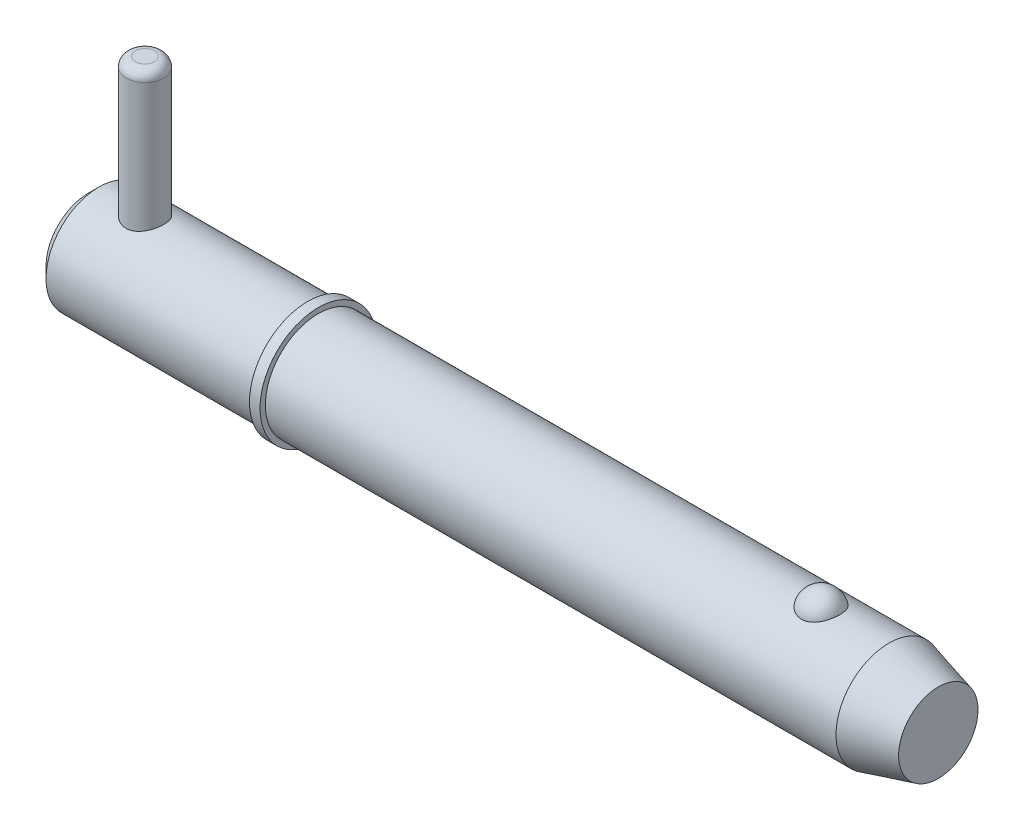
ISO-10303-21;
HEADER;
FILE_DESCRIPTION(('STEP AP214'),'2;1');
FILE_NAME('part.step','',(''),(''),'','','');
FILE_SCHEMA(('AUTOMOTIVE_DESIGN { 1 0 10303 214 1 1 1 1 }'));
ENDSEC;
DATA;
#1=APPLICATION_CONTEXT('core data for automotive mechanical design processes');
#2=APPLICATION_PROTOCOL_DEFINITION('international standard','automotive_design',2000,#1);
#3=PRODUCT_CONTEXT('',#1,'mechanical');
#4=PRODUCT('Part','Part','',(#3));
#5=PRODUCT_RELATED_PRODUCT_CATEGORY('part','',(#4));
#6=PRODUCT_DEFINITION_FORMATION('','',#4);
#7=PRODUCT_DEFINITION_CONTEXT('part definition',#1,'design');
#8=PRODUCT_DEFINITION('design','',#6,#7);
#9=PRODUCT_DEFINITION_SHAPE('','',#8);
#10=(LENGTH_UNIT() NAMED_UNIT(*) SI_UNIT(.MILLI.,.METRE.));
#11=(NAMED_UNIT(*) PLANE_ANGLE_UNIT() SI_UNIT($,.RADIAN.));
#12=(NAMED_UNIT(*) SI_UNIT($,.STERADIAN.) SOLID_ANGLE_UNIT());
#13=UNCERTAINTY_MEASURE_WITH_UNIT(LENGTH_MEASURE(1.E-05),#10,'distance_accuracy_value','');
#14=(GEOMETRIC_REPRESENTATION_CONTEXT(3) GLOBAL_UNCERTAINTY_ASSIGNED_CONTEXT((#13)) GLOBAL_UNIT_ASSIGNED_CONTEXT((#10,
#11,#12)) REPRESENTATION_CONTEXT('',''));
#15=CARTESIAN_POINT('',(0.,0.,0.));
#16=DIRECTION('',(0.,0.,1.));
#17=DIRECTION('',(1.,0.,0.));
#18=AXIS2_PLACEMENT_3D('',#15,#16,#17);
#19=CARTESIAN_POINT('',(5.94,19.845,0.));
#20=DIRECTION('',(0.,-1.,0.));
#21=DIRECTION('',(0.,0.,-1.));
#22=AXIS2_PLACEMENT_3D('',#19,#20,#21);
#23=CYLINDRICAL_SURFACE('',#22,1.98);
#24=CARTESIAN_POINT('',(5.94,-4.565,0.));
#25=DIRECTION('',(0.,1.,0.));
#26=DIRECTION('',(0.,0.,1.));
#27=AXIS2_PLACEMENT_3D('',#24,#25,#26);
#28=CIRCLE('',#27,1.98);
#29=CARTESIAN_POINT('',(5.94,-4.565,1.98));
#30=VERTEX_POINT('',#29);
#31=EDGE_CURVE('P0_E25',#30,#30,#28,.T.);
#32=ORIENTED_EDGE('',*,*,#31,.T.);
#33=EDGE_LOOP('',(#32));
#34=FACE_BOUND('',#33,.T.);
#35=CARTESIAN_POINT('',(5.94,18.855,0.));
#36=DIRECTION('',(0.,1.,0.));
#37=DIRECTION('',(0.,0.,1.));
#38=AXIS2_PLACEMENT_3D('',#35,#36,#37);
#39=CIRCLE('',#38,1.98);
#40=CARTESIAN_POINT('',(5.94,18.855,1.98));
#41=VERTEX_POINT('',#40);
#42=EDGE_CURVE('P0_E29',#41,#41,#39,.F.);
#43=ORIENTED_EDGE('',*,*,#42,.T.);
#44=EDGE_LOOP('',(#43));
#45=FACE_BOUND('',#44,.T.);
#46=ADVANCED_FACE('P0_F14',(#34,#45),#23,.T.);
#47=CARTESIAN_POINT('',(5.94,19.845,0.));
#48=DIRECTION('',(0.,1.,0.));
#49=DIRECTION('',(0.,0.,1.));
#50=AXIS2_PLACEMENT_3D('',#47,#48,#49);
#51=PLANE('',#50);
#52=CARTESIAN_POINT('',(5.94,19.845,0.));
#53=DIRECTION('',(0.,1.,0.));
#54=DIRECTION('',(0.,0.,1.));
#55=AXIS2_PLACEMENT_3D('',#52,#53,#54);
#56=CIRCLE('',#55,0.99);
#57=CARTESIAN_POINT('',(5.94,19.845,0.99));
#58=VERTEX_POINT('',#57);
#59=EDGE_CURVE('P0_E10',#58,#58,#56,.T.);
#60=ORIENTED_EDGE('',*,*,#59,.T.);
#61=EDGE_LOOP('',(#60));
#62=FACE_BOUND('',#61,.T.);
#63=ADVANCED_FACE('P0_F46',(#62),#51,.T.);
#64=CARTESIAN_POINT('',(5.94,-5.555,0.));
#65=DIRECTION('',(0.,1.,0.));
#66=DIRECTION('',(0.,0.,1.));
#67=AXIS2_PLACEMENT_3D('',#64,#65,#66);
#68=PLANE('',#67);
#69=CARTESIAN_POINT('',(5.94,-5.555,0.));
#70=DIRECTION('',(0.,1.,0.));
#71=DIRECTION('',(0.,0.,1.));
#72=AXIS2_PLACEMENT_3D('',#69,#70,#71);
#73=CIRCLE('',#72,0.99);
#74=CARTESIAN_POINT('',(5.94,-5.555,0.99));
#75=VERTEX_POINT('',#74);
#76=EDGE_CURVE('P0_E21',#75,#75,#73,.F.);
#77=ORIENTED_EDGE('',*,*,#76,.T.);
#78=EDGE_LOOP('',(#77));
#79=FACE_BOUND('',#78,.T.);
#80=ADVANCED_FACE('P0_F43',(#79),#68,.F.);
#81=CARTESIAN_POINT('',(5.94,-4.565,0.));
#82=DIRECTION('',(0.,1.,0.));
#83=DIRECTION('',(0.,0.,1.));
#84=AXIS2_PLACEMENT_3D('',#81,#82,#83);
#85=DEGENERATE_TOROIDAL_SURFACE('',#84,0.99,0.99,.T.);
#86=ORIENTED_EDGE('',*,*,#76,.F.);
#87=EDGE_LOOP('',(#86));
#88=FACE_BOUND('',#87,.T.);
#89=ORIENTED_EDGE('',*,*,#31,.F.);
#90=EDGE_LOOP('',(#89));
#91=FACE_BOUND('',#90,.T.);
#92=ADVANCED_FACE('P0_F38',(#88,#91),#85,.T.);
#93=CARTESIAN_POINT('',(5.94,18.855,0.));
#94=DIRECTION('',(0.,1.,0.));
#95=DIRECTION('',(0.,0.,1.));
#96=AXIS2_PLACEMENT_3D('',#93,#94,#95);
#97=DEGENERATE_TOROIDAL_SURFACE('',#96,0.99,0.99,.T.);
#98=ORIENTED_EDGE('',*,*,#42,.F.);
#99=EDGE_LOOP('',(#98));
#100=FACE_BOUND('',#99,.T.);
#101=ORIENTED_EDGE('',*,*,#59,.F.);
#102=EDGE_LOOP('',(#101));
#103=FACE_BOUND('',#102,.T.);
#104=ADVANCED_FACE('P0_F16',(#100,#103),#97,.T.);
#105=CLOSED_SHELL('',(#46,#63,#80,#92,#104));
#106=MANIFOLD_SOLID_BREP('P0_B1',#105);
#107=CARTESIAN_POINT('',(0.,0.,0.));
#108=DIRECTION('',(1.,0.,0.));
#109=DIRECTION('',(0.,0.,-1.));
#110=AXIS2_PLACEMENT_3D('',#107,#108,#109);
#111=CYLINDRICAL_SURFACE('',#110,5.555);
#112=CARTESIAN_POINT('',(84.0171144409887,0.,0.));
#113=DIRECTION('',(1.,0.,0.));
#114=DIRECTION('',(0.,0.,-1.));
#115=AXIS2_PLACEMENT_3D('',#112,#113,#114);
#116=CIRCLE('',#115,5.555);
#117=CARTESIAN_POINT('',(84.0171144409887,0.,-5.555));
#118=VERTEX_POINT('',#117);
#119=EDGE_CURVE('P1_E81',#118,#118,#116,.T.);
#120=ORIENTED_EDGE('',*,*,#119,.F.);
#121=EDGE_LOOP('',(#120));
#122=FACE_BOUND('',#121,.T.);
#123=CARTESIAN_POINT('',(24.13,0.,0.));
#124=DIRECTION('',(1.,0.,0.));
#125=DIRECTION('',(0.,0.,-1.));
#126=AXIS2_PLACEMENT_3D('',#123,#124,#125);
#127=CIRCLE('',#126,5.555);
#128=CARTESIAN_POINT('',(24.13,0.,-5.555));
#129=VERTEX_POINT('',#128);
#130=EDGE_CURVE('P1_E85',#129,#129,#127,.T.);
#131=ORIENTED_EDGE('',*,*,#130,.T.);
#132=EDGE_LOOP('',(#131));
#133=FACE_BOUND('',#132,.T.);
#134=CARTESIAN_POINT('',(76.8986264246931,5.16741224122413,2.03859650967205));
#135=CARTESIAN_POINT('',(76.7929492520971,5.16740893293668,2.03859990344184));
#136=CARTESIAN_POINT('',(76.68729894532,5.17079470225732,2.03008306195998));
#137=CARTESIAN_POINT('',(76.4791419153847,5.18392795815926,1.9963072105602));
#138=CARTESIAN_POINT('',(76.3766344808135,5.19367399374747,1.9710520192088));
#139=CARTESIAN_POINT('',(76.1777710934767,5.21839168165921,1.90463997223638));
#140=CARTESIAN_POINT('',(76.0814064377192,5.23335573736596,1.86350622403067));
#141=CARTESIAN_POINT('',(75.8970804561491,5.26688076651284,1.76652592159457));
#142=CARTESIAN_POINT('',(75.8091207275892,5.28544242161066,1.71067657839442));
#143=CARTESIAN_POINT('',(75.6412654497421,5.32479845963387,1.58399959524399));
#144=CARTESIAN_POINT('',(75.5616656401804,5.34564089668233,1.51279545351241));
#145=CARTESIAN_POINT('',(75.4151290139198,5.38697258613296,1.35828584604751));
#146=CARTESIAN_POINT('',(75.348194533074,5.40746177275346,1.27497815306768));
#147=CARTESIAN_POINT('',(75.2256103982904,5.44694508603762,1.09440293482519));
#148=CARTESIAN_POINT('',(75.1705989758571,5.46583143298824,0.996677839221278));
#149=CARTESIAN_POINT('',(75.0769376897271,5.49908030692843,0.792961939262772));
#150=CARTESIAN_POINT('',(75.0382894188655,5.513442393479,0.686970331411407));
#151=CARTESIAN_POINT('',(74.9776807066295,5.536358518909,0.468019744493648));
#152=CARTESIAN_POINT('',(74.9559725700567,5.54482455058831,0.354981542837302));
#153=CARTESIAN_POINT('',(74.9306362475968,5.55473324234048,0.126595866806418));
#154=CARTESIAN_POINT('',(74.9270077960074,5.55617600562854,0.0112484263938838));
#155=CARTESIAN_POINT('',(74.9378817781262,5.55189984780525,-0.218011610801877));
#156=CARTESIAN_POINT('',(74.9523151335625,5.54620821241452,-0.331928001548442));
#157=CARTESIAN_POINT('',(74.998903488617,5.52828920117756,-0.555544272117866));
#158=CARTESIAN_POINT('',(75.0310588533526,5.5160616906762,-0.665244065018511));
#159=CARTESIAN_POINT('',(75.1124883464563,5.48630779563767,-0.877469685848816));
#160=CARTESIAN_POINT('',(75.1617816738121,5.4687754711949,-0.979987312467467));
#161=CARTESIAN_POINT('',(75.2764785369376,5.43024700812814,-1.17486975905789));
#162=CARTESIAN_POINT('',(75.3418831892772,5.4092506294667,-1.26723387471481));
#163=CARTESIAN_POINT('',(75.4875712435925,5.36600927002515,-1.43940133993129));
#164=CARTESIAN_POINT('',(75.5678859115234,5.34376173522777,-1.5191776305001));
#165=CARTESIAN_POINT('',(75.7414520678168,5.30057971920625,-1.66360338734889));
#166=CARTESIAN_POINT('',(75.834702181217,5.27964509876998,-1.72825445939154));
#167=CARTESIAN_POINT('',(76.0293939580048,5.24205250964,-1.8390947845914));
#168=CARTESIAN_POINT('',(76.1305900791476,5.22530519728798,-1.88568407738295));
#169=CARTESIAN_POINT('',(76.3401552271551,5.19750919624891,-1.96100802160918));
#170=CARTESIAN_POINT('',(76.4485215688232,5.18645838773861,-1.98974931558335));
#171=CARTESIAN_POINT('',(76.6634989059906,5.17184410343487,-2.02742262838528));
#172=CARTESIAN_POINT('',(76.769925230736,5.16793282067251,-2.0372760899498));
#173=CARTESIAN_POINT('',(76.9829925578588,5.1669899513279,-2.03966777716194));
#174=CARTESIAN_POINT('',(77.0896335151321,5.16995704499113,-2.03220932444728));
#175=CARTESIAN_POINT('',(77.2967730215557,5.18222383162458,-2.0007117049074));
#176=CARTESIAN_POINT('',(77.3973599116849,5.19133213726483,-1.97717337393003));
#177=CARTESIAN_POINT('',(77.5930141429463,5.21467637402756,-1.91475248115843));
#178=CARTESIAN_POINT('',(77.6880810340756,5.22891272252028,-1.87586867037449));
#179=CARTESIAN_POINT('',(77.872371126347,5.26137066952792,-1.78282713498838));
#180=CARTESIAN_POINT('',(77.9614190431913,5.27967329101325,-1.7283512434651));
#181=CARTESIAN_POINT('',(78.1292880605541,5.31817411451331,-1.60597483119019));
#182=CARTESIAN_POINT('',(78.2081068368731,5.33837274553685,-1.53807126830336));
#183=CARTESIAN_POINT('',(78.3575156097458,5.37968287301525,-1.38688970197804));
#184=CARTESIAN_POINT('',(78.4275058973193,5.40079011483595,-1.30301744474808));
#185=CARTESIAN_POINT('',(78.5530125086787,5.44074401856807,-1.12458170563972));
#186=CARTESIAN_POINT('',(78.6085262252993,5.45959027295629,-1.03001630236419));
#187=CARTESIAN_POINT('',(78.7055507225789,5.49369849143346,-0.829439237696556));
#188=CARTESIAN_POINT('',(78.7465483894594,5.50882422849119,-0.723155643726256));
#189=CARTESIAN_POINT('',(78.8111250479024,5.53310911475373,-0.504772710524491));
#190=CARTESIAN_POINT('',(78.8347036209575,5.54226812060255,-0.39267323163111));
#191=CARTESIAN_POINT('',(78.864013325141,5.55370358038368,-0.165459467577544));
#192=CARTESIAN_POINT('',(78.8696884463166,5.55595843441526,-0.0503368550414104));
#193=CARTESIAN_POINT('',(78.862916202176,5.55329317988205,0.179288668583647));
#194=CARTESIAN_POINT('',(78.8504690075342,5.54837313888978,0.293791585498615));
#195=CARTESIAN_POINT('',(78.8077798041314,5.53189037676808,0.518526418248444));
#196=CARTESIAN_POINT('',(78.777598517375,5.5203503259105,0.628771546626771));
#197=CARTESIAN_POINT('',(78.7000962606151,5.49182453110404,0.84231815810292));
#198=CARTESIAN_POINT('',(78.6527743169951,5.47483847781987,0.945619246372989));
#199=CARTESIAN_POINT('',(78.5417204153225,5.43710633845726,1.14281571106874));
#200=CARTESIAN_POINT('',(78.4779215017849,5.41634501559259,1.23667048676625));
#201=CARTESIAN_POINT('',(78.3353577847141,5.37334572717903,1.4118524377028));
#202=CARTESIAN_POINT('',(78.2565932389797,5.35110778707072,1.49317982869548));
#203=CARTESIAN_POINT('',(78.0864234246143,5.30779474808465,1.64049162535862));
#204=CARTESIAN_POINT('',(77.9951002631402,5.28671324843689,1.70656877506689));
#205=CARTESIAN_POINT('',(77.8017390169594,5.2480485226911,1.82201372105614));
#206=CARTESIAN_POINT('',(77.6997005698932,5.23046541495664,1.87138095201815));
#207=CARTESIAN_POINT('',(77.4836187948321,5.20042692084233,1.95335298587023));
#208=CARTESIAN_POINT('',(77.369260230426,5.18820192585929,1.98521734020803));
#209=CARTESIAN_POINT('',(77.1361307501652,5.17169804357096,2.02783294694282));
#210=CARTESIAN_POINT('',(77.0173616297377,5.16741595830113,2.03859269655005));
#211=CARTESIAN_POINT('',(76.8986264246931,5.16741224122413,2.03859650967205));
#212=B_SPLINE_CURVE_WITH_KNOTS('',3,(#134,#135,#136,#137,#138,#139,#140,#141,#142,#143,#144,
#145,#146,#147,#148,#149,#150,#151,#152,#153,#154,#155,#156,#157,#158,#159,#160,#161,#162,#163,
#164,#165,#166,#167,#168,#169,#170,#171,#172,#173,#174,#175,#176,#177,#178,#179,#180,#181,#182,
#183,#184,#185,#186,#187,#188,#189,#190,#191,#192,#193,#194,#195,#196,#197,#198,#199,#200,#201,
#202,#203,#204,#205,#206,#207,#208,#209,#210,#211),.UNSPECIFIED.,.T.,.F.,(4,2,2,2,2,2,2,2,2,2,2,
2,2,2,2,2,2,2,2,2,2,2,2,2,2,2,2,2,2,2,2,2,2,2,2,2,2,2,4),(0.,0.316595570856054,
0.633118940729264,0.949183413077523,1.26530783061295,1.59030762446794,1.91536729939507,
2.25495824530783,2.59458224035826,2.93917283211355,3.28375835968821,3.62703002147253,
3.97030875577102,4.3139732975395,4.65766166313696,5.00207904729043,5.3464598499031,
5.68270547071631,6.0188258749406,6.33808403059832,6.65728093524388,6.96696376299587,
7.27667180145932,7.59321535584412,7.90983070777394,8.24210387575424,8.57443684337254,
8.91755896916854,9.26068933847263,9.60489211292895,9.949091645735,10.2921194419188,
10.6351667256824,10.9796305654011,11.324088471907,11.666392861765,12.0087088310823,
12.3645679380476,12.7202837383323),.UNSPECIFIED.);
#213=CARTESIAN_POINT('',(76.8986264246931,5.16741224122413,2.03859650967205));
#214=VERTEX_POINT('',#213);
#215=EDGE_CURVE('P1_E35',#214,#214,#212,.T.);
#216=ORIENTED_EDGE('',*,*,#215,.T.);
#217=EDGE_LOOP('',(#216));
#218=FACE_BOUND('',#217,.T.);
#219=ADVANCED_FACE('P1_F13',(#122,#133,#218),#111,.T.);
#220=CARTESIAN_POINT('',(0.,0.,0.));
#221=DIRECTION('',(-1.,0.,0.));
#222=DIRECTION('',(0.,0.,1.));
#223=AXIS2_PLACEMENT_3D('',#220,#221,#222);
#224=PLANE('',#223);
#225=CARTESIAN_POINT('',(0.,0.,0.));
#226=DIRECTION('',(1.,0.,0.));
#227=DIRECTION('',(0.,0.,-1.));
#228=AXIS2_PLACEMENT_3D('',#225,#226,#227);
#229=CIRCLE('',#228,4.444);
#230=CARTESIAN_POINT('',(0.,0.,-4.444));
#231=VERTEX_POINT('',#230);
#232=EDGE_CURVE('P1_E9',#231,#231,#229,.T.);
#233=ORIENTED_EDGE('',*,*,#232,.F.);
#234=EDGE_LOOP('',(#233));
#235=FACE_BOUND('',#234,.T.);
#236=ADVANCED_FACE('P1_F15',(#235),#224,.T.);
#237=CARTESIAN_POINT('',(1.111,0.,0.));
#238=DIRECTION('',(1.,0.,0.));
#239=DIRECTION('',(0.,0.,-1.));
#240=AXIS2_PLACEMENT_3D('',#237,#238,#239);
#241=CONICAL_SURFACE('',#240,5.555,0.78539816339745);
#242=ORIENTED_EDGE('',*,*,#232,.T.);
#243=EDGE_LOOP('',(#242));
#244=FACE_BOUND('',#243,.T.);
#245=CARTESIAN_POINT('',(1.111,0.,0.));
#246=DIRECTION('',(1.,0.,0.));
#247=DIRECTION('',(0.,0.,-1.));
#248=AXIS2_PLACEMENT_3D('',#245,#246,#247);
#249=CIRCLE('',#248,5.555);
#250=CARTESIAN_POINT('',(1.111,0.,-5.555));
#251=VERTEX_POINT('',#250);
#252=EDGE_CURVE('P1_E26',#251,#251,#249,.T.);
#253=ORIENTED_EDGE('',*,*,#252,.F.);
#254=EDGE_LOOP('',(#253));
#255=FACE_BOUND('',#254,.T.);
#256=ADVANCED_FACE('P1_F77',(#244,#255),#241,.T.);
#257=CARTESIAN_POINT('',(0.,0.,0.));
#258=DIRECTION('',(1.,0.,0.));
#259=DIRECTION('',(0.,0.,-1.));
#260=AXIS2_PLACEMENT_3D('',#257,#258,#259);
#261=CYLINDRICAL_SURFACE('',#260,5.555);
#262=CARTESIAN_POINT('',(5.94,-5.19014691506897,1.98));
#263=CARTESIAN_POINT('',(5.83264687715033,-5.19014494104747,1.98000226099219));
#264=CARTESIAN_POINT('',(5.7253094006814,-5.19351395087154,1.97123988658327));
#265=CARTESIAN_POINT('',(5.51384517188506,-5.20654291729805,1.93656219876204));
#266=CARTESIAN_POINT('',(5.40971858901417,-5.21620320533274,1.91064598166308));
#267=CARTESIAN_POINT('',(5.20778082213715,-5.24058443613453,1.84271148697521));
#268=CARTESIAN_POINT('',(5.10995634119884,-5.25529427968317,1.80072850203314));
#269=CARTESIAN_POINT('',(4.92270352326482,-5.28810012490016,1.70197537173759));
#270=CARTESIAN_POINT('',(4.83327743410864,-5.3061970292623,1.64520128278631));
#271=CARTESIAN_POINT('',(4.66135184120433,-5.34464714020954,1.51575187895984));
#272=CARTESIAN_POINT('',(4.57928277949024,-5.36506222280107,1.44252311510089));
#273=CARTESIAN_POINT('',(4.42829115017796,-5.40532920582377,1.28342047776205));
#274=CARTESIAN_POINT('',(4.35937105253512,-5.42518099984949,1.19754423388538));
#275=CARTESIAN_POINT('',(4.23461605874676,-5.46281133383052,1.01237205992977));
#276=CARTESIAN_POINT('',(4.17924129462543,-5.48050875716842,0.912748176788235));
#277=CARTESIAN_POINT('',(4.0862117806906,-5.51109938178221,0.70485824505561));
#278=CARTESIAN_POINT('',(4.0485515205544,-5.52399407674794,0.596594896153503));
#279=CARTESIAN_POINT('',(3.99350662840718,-5.54308759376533,0.379019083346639));
#280=CARTESIAN_POINT('',(3.97538263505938,-5.54952987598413,0.269915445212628));
#281=CARTESIAN_POINT('',(3.95756405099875,-5.55586205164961,0.0500378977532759));
#282=CARTESIAN_POINT('',(3.95786404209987,-5.55575387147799,-0.060735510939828));
#283=CARTESIAN_POINT('',(3.97643665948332,-5.54915684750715,-0.275539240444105));
#284=CARTESIAN_POINT('',(3.99390415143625,-5.54295384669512,-0.379649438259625));
#285=CARTESIAN_POINT('',(4.0449721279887,-5.52523170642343,-0.583350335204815));
#286=CARTESIAN_POINT('',(4.07857373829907,-5.51371219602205,-0.682940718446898));
#287=CARTESIAN_POINT('',(4.16137312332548,-5.4863099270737,-0.876423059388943));
#288=CARTESIAN_POINT('',(4.2107826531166,-5.47036834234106,-0.970215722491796));
#289=CARTESIAN_POINT('',(4.32361427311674,-5.43575653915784,-1.1484017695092));
#290=CARTESIAN_POINT('',(4.38704062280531,-5.41708549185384,-1.23279228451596));
#291=CARTESIAN_POINT('',(4.53006791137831,-5.37778429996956,-1.39454579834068));
#292=CARTESIAN_POINT('',(4.61035105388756,-5.35710277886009,-1.4712940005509));
#293=CARTESIAN_POINT('',(4.78279835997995,-5.31692766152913,-1.6104545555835));
#294=CARTESIAN_POINT('',(4.874964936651,-5.29743430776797,-1.67286398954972));
#295=CARTESIAN_POINT('',(5.07076688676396,-5.26153775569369,-1.78259698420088));
#296=CARTESIAN_POINT('',(5.17458163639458,-5.24519780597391,-1.8296227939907));
#297=CARTESIAN_POINT('',(5.38938990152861,-5.21818744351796,-1.90530278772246));
#298=CARTESIAN_POINT('',(5.50037985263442,-5.20751423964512,-1.93396601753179));
#299=CARTESIAN_POINT('',(5.72036376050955,-5.19369176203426,-1.97077654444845));
#300=CARTESIAN_POINT('',(5.82917370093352,-5.19018851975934,-1.97989015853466));
#301=CARTESIAN_POINT('',(6.04680100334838,-5.19010609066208,-1.98010779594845));
#302=CARTESIAN_POINT('',(6.15561835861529,-5.19352540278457,-1.97121572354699));
#303=CARTESIAN_POINT('',(6.36548036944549,-5.20654623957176,-1.93654727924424));
#304=CARTESIAN_POINT('',(6.46666051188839,-5.21588705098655,-1.91148218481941));
#305=CARTESIAN_POINT('',(6.66334537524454,-5.23939939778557,-1.84605494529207));
#306=CARTESIAN_POINT('',(6.75884899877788,-5.25357186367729,-1.8056898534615));
#307=CARTESIAN_POINT('',(6.94517989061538,-5.28576258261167,-1.70921153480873));
#308=CARTESIAN_POINT('',(7.03572661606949,-5.30389804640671,-1.65259670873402));
#309=CARTESIAN_POINT('',(7.20638087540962,-5.34176077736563,-1.52577523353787));
#310=CARTESIAN_POINT('',(7.28648490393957,-5.36148857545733,-1.45556404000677));
#311=CARTESIAN_POINT('',(7.43864697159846,-5.40165494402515,-1.2988614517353));
#312=CARTESIAN_POINT('',(7.50999887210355,-5.42207106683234,-1.21167640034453));
#313=CARTESIAN_POINT('',(7.63712639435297,-5.46023601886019,-1.026066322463));
#314=CARTESIAN_POINT('',(7.69290228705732,-5.47798489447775,-0.927641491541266));
#315=CARTESIAN_POINT('',(7.78684673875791,-5.50876590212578,-0.722633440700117));
#316=CARTESIAN_POINT('',(7.82510508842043,-5.52182201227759,-0.616095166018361));
#317=CARTESIAN_POINT('',(7.88297051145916,-5.54184206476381,-0.397530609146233));
#318=CARTESIAN_POINT('',(7.90258540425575,-5.5488085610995,-0.285506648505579));
#319=CARTESIAN_POINT('',(7.9218262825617,-5.55564472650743,-0.065566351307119));
#320=CARTESIAN_POINT('',(7.92245987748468,-5.55587212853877,0.0422515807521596));
#321=CARTESIAN_POINT('',(7.90626329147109,-5.55011340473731,0.256387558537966));
#322=CARTESIAN_POINT('',(7.88943488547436,-5.54412791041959,0.362705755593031));
#323=CARTESIAN_POINT('',(7.83948457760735,-5.52676548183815,0.568649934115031));
#324=CARTESIAN_POINT('',(7.8067003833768,-5.51550046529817,0.668367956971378));
#325=CARTESIAN_POINT('',(7.72609369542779,-5.48874437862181,0.860911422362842));
#326=CARTESIAN_POINT('',(7.67826838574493,-5.47325251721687,0.953735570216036));
#327=CARTESIAN_POINT('',(7.56675024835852,-5.43884382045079,1.13391068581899));
#328=CARTESIAN_POINT('',(7.50249968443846,-5.41981485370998,1.22089468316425));
#329=CARTESIAN_POINT('',(7.36086495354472,-5.38069275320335,1.38316665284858));
#330=CARTESIAN_POINT('',(7.28347630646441,-5.36059925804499,1.45845061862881));
#331=CARTESIAN_POINT('',(7.11347587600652,-5.32048380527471,1.59876646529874));
#332=CARTESIAN_POINT('',(7.02032386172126,-5.30050854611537,1.66315951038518));
#333=CARTESIAN_POINT('',(6.82388804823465,-5.26398994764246,1.77536801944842));
#334=CARTESIAN_POINT('',(6.7206049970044,-5.24744635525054,1.82318470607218));
#335=CARTESIAN_POINT('',(6.50639706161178,-5.21987969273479,1.90068230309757));
#336=CARTESIAN_POINT('',(6.3954529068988,-5.20887116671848,1.93031547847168));
#337=CARTESIAN_POINT('',(6.16966522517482,-5.19400760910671,1.96996824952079));
#338=CARTESIAN_POINT('',(6.05482366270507,-5.19014902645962,1.97999758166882));
#339=CARTESIAN_POINT('',(5.94,-5.19014691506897,1.98));
#340=B_SPLINE_CURVE_WITH_KNOTS('',3,(#262,#263,#264,#265,#266,#267,#268,#269,#270,#271,#272,
#273,#274,#275,#276,#277,#278,#279,#280,#281,#282,#283,#284,#285,#286,#287,#288,#289,#290,#291,
#292,#293,#294,#295,#296,#297,#298,#299,#300,#301,#302,#303,#304,#305,#306,#307,#308,#309,#310,
#311,#312,#313,#314,#315,#316,#317,#318,#319,#320,#321,#322,#323,#324,#325,#326,#327,#328,#329,
#330,#331,#332,#333,#334,#335,#336,#337,#338,#339),.UNSPECIFIED.,.T.,.F.,(4,2,2,2,2,2,2,2,2,2,2,
2,2,2,2,2,2,2,2,2,2,2,2,2,2,2,2,2,2,2,2,2,2,2,2,2,2,2,4),(0.,0.321632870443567,
0.643282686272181,0.964229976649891,1.28526292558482,1.61937087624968,1.9535415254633,
2.29784481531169,2.64204093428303,2.97269632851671,3.30325448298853,3.61901541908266,
3.93479838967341,4.25500220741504,4.57530346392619,4.91268648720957,5.25013812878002,
5.59378026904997,5.93725299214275,6.26331481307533,6.58930593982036,6.90185604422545,
7.21446637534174,7.53801472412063,7.86167140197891,8.20353561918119,8.54539388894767,
8.88547970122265,9.22542281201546,9.54728637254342,9.86911722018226,10.1844146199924,
10.4997710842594,10.827730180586,11.1558013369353,11.499115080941,11.8424034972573,
12.1865892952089,12.5306041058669),.UNSPECIFIED.);
#341=CARTESIAN_POINT('',(5.94,-5.19014691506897,1.98));
#342=VERTEX_POINT('',#341);
#343=EDGE_CURVE('P1_E17',#342,#342,#340,.T.);
#344=ORIENTED_EDGE('',*,*,#343,.F.);
#345=EDGE_LOOP('',(#344));
#346=FACE_BOUND('',#345,.T.);
#347=CARTESIAN_POINT('',(5.94,5.19014691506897,1.98));
#348=CARTESIAN_POINT('',(6.04735312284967,5.19014494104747,1.98000226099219));
#349=CARTESIAN_POINT('',(6.1546905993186,5.19351395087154,1.97123988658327));
#350=CARTESIAN_POINT('',(6.36615482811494,5.20654291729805,1.93656219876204));
#351=CARTESIAN_POINT('',(6.47028141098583,5.21620320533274,1.91064598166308));
#352=CARTESIAN_POINT('',(6.67221917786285,5.24058443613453,1.84271148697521));
#353=CARTESIAN_POINT('',(6.77004365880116,5.25529427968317,1.80072850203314));
#354=CARTESIAN_POINT('',(6.95729647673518,5.28810012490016,1.70197537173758));
#355=CARTESIAN_POINT('',(7.04672256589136,5.3061970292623,1.64520128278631));
#356=CARTESIAN_POINT('',(7.21864815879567,5.34464714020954,1.51575187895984));
#357=CARTESIAN_POINT('',(7.30071722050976,5.36506222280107,1.44252311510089));
#358=CARTESIAN_POINT('',(7.45170884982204,5.40532920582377,1.28342047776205));
#359=CARTESIAN_POINT('',(7.52062894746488,5.42518099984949,1.19754423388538));
#360=CARTESIAN_POINT('',(7.64538394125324,5.46281133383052,1.01237205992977));
#361=CARTESIAN_POINT('',(7.70075870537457,5.48050875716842,0.912748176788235));
#362=CARTESIAN_POINT('',(7.7937882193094,5.51109938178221,0.704858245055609));
#363=CARTESIAN_POINT('',(7.8314484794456,5.52399407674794,0.596594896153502));
#364=CARTESIAN_POINT('',(7.88649337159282,5.54308759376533,0.379019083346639));
#365=CARTESIAN_POINT('',(7.90461736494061,5.54952987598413,0.269915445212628));
#366=CARTESIAN_POINT('',(7.92243594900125,5.55586205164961,0.0500378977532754));
#367=CARTESIAN_POINT('',(7.92213595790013,5.55575387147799,-0.0607355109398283));
#368=CARTESIAN_POINT('',(7.90356334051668,5.54915684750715,-0.275539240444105));
#369=CARTESIAN_POINT('',(7.88609584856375,5.54295384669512,-0.379649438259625));
#370=CARTESIAN_POINT('',(7.8350278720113,5.52523170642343,-0.583350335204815));
#371=CARTESIAN_POINT('',(7.80142626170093,5.51371219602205,-0.682940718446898));
#372=CARTESIAN_POINT('',(7.71862687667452,5.4863099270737,-0.876423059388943));
#373=CARTESIAN_POINT('',(7.6692173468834,5.47036834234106,-0.970215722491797));
#374=CARTESIAN_POINT('',(7.55638572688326,5.43575653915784,-1.1484017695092));
#375=CARTESIAN_POINT('',(7.49295937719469,5.41708549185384,-1.23279228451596));
#376=CARTESIAN_POINT('',(7.34993208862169,5.37778429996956,-1.39454579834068));
#377=CARTESIAN_POINT('',(7.26964894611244,5.35710277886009,-1.4712940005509));
#378=CARTESIAN_POINT('',(7.09720164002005,5.31692766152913,-1.6104545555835));
#379=CARTESIAN_POINT('',(7.00503506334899,5.29743430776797,-1.67286398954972));
#380=CARTESIAN_POINT('',(6.80923311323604,5.26153775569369,-1.78259698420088));
#381=CARTESIAN_POINT('',(6.70541836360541,5.24519780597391,-1.8296227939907));
#382=CARTESIAN_POINT('',(6.49061009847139,5.21818744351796,-1.90530278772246));
#383=CARTESIAN_POINT('',(6.37962014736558,5.20751423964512,-1.93396601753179));
#384=CARTESIAN_POINT('',(6.15963623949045,5.19369176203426,-1.97077654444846));
#385=CARTESIAN_POINT('',(6.05082629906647,5.19018851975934,-1.97989015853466));
#386=CARTESIAN_POINT('',(5.83319899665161,5.19010609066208,-1.98010779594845));
#387=CARTESIAN_POINT('',(5.7243816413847,5.19352540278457,-1.97121572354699));
#388=CARTESIAN_POINT('',(5.5145196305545,5.20654623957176,-1.93654727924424));
#389=CARTESIAN_POINT('',(5.4133394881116,5.21588705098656,-1.91148218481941));
#390=CARTESIAN_POINT('',(5.21665462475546,5.23939939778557,-1.84605494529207));
#391=CARTESIAN_POINT('',(5.12115100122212,5.25357186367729,-1.8056898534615));
#392=CARTESIAN_POINT('',(4.93482010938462,5.28576258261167,-1.70921153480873));
#393=CARTESIAN_POINT('',(4.84427338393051,5.30389804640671,-1.65259670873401));
#394=CARTESIAN_POINT('',(4.67361912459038,5.34176077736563,-1.52577523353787));
#395=CARTESIAN_POINT('',(4.59351509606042,5.36148857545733,-1.45556404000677));
#396=CARTESIAN_POINT('',(4.44135302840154,5.40165494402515,-1.2988614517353));
#397=CARTESIAN_POINT('',(4.37000112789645,5.42207106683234,-1.21167640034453));
#398=CARTESIAN_POINT('',(4.24287360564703,5.46023601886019,-1.026066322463));
#399=CARTESIAN_POINT('',(4.18709771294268,5.47798489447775,-0.927641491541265));
#400=CARTESIAN_POINT('',(4.09315326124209,5.50876590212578,-0.722633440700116));
#401=CARTESIAN_POINT('',(4.05489491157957,5.52182201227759,-0.61609516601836));
#402=CARTESIAN_POINT('',(3.99702948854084,5.54184206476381,-0.397530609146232));
#403=CARTESIAN_POINT('',(3.97741459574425,5.5488085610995,-0.285506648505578));
#404=CARTESIAN_POINT('',(3.9581737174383,5.55564472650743,-0.0655663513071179));
#405=CARTESIAN_POINT('',(3.95754012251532,5.55587212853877,0.0422515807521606));
#406=CARTESIAN_POINT('',(3.97373670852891,5.55011340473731,0.256387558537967));
#407=CARTESIAN_POINT('',(3.99056511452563,5.54412791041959,0.362705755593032));
#408=CARTESIAN_POINT('',(4.04051542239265,5.52676548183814,0.568649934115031));
#409=CARTESIAN_POINT('',(4.07329961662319,5.51550046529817,0.668367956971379));
#410=CARTESIAN_POINT('',(4.15390630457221,5.48874437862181,0.860911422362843));
#411=CARTESIAN_POINT('',(4.20173161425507,5.47325251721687,0.953735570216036));
#412=CARTESIAN_POINT('',(4.31324975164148,5.43884382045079,1.13391068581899));
#413=CARTESIAN_POINT('',(4.37750031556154,5.41981485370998,1.22089468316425));
#414=CARTESIAN_POINT('',(4.51913504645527,5.38069275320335,1.38316665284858));
#415=CARTESIAN_POINT('',(4.59652369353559,5.36059925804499,1.45845061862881));
#416=CARTESIAN_POINT('',(4.76652412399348,5.32048380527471,1.59876646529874));
#417=CARTESIAN_POINT('',(4.85967613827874,5.30050854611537,1.66315951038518));
#418=CARTESIAN_POINT('',(5.05611195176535,5.26398994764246,1.77536801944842));
#419=CARTESIAN_POINT('',(5.1593950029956,5.24744635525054,1.82318470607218));
#420=CARTESIAN_POINT('',(5.37360293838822,5.21987969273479,1.90068230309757));
#421=CARTESIAN_POINT('',(5.4845470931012,5.20887116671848,1.93031547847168));
#422=CARTESIAN_POINT('',(5.71033477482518,5.19400760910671,1.96996824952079));
#423=CARTESIAN_POINT('',(5.82517633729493,5.19014902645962,1.97999758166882));
#424=CARTESIAN_POINT('',(5.94,5.19014691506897,1.98));
#425=B_SPLINE_CURVE_WITH_KNOTS('',3,(#347,#348,#349,#350,#351,#352,#353,#354,#355,#356,#357,
#358,#359,#360,#361,#362,#363,#364,#365,#366,#367,#368,#369,#370,#371,#372,#373,#374,#375,#376,
#377,#378,#379,#380,#381,#382,#383,#384,#385,#386,#387,#388,#389,#390,#391,#392,#393,#394,#395,
#396,#397,#398,#399,#400,#401,#402,#403,#404,#405,#406,#407,#408,#409,#410,#411,#412,#413,#414,
#415,#416,#417,#418,#419,#420,#421,#422,#423,#424),.UNSPECIFIED.,.T.,.F.,(4,2,2,2,2,2,2,2,2,2,2,
2,2,2,2,2,2,2,2,2,2,2,2,2,2,2,2,2,2,2,2,2,2,2,2,2,2,2,4),(0.,0.321632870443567,
0.643282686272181,0.964229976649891,1.28526292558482,1.61937087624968,1.9535415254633,
2.29784481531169,2.64204093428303,2.97269632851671,3.30325448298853,3.61901541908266,
3.93479838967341,4.25500220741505,4.57530346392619,4.91268648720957,5.25013812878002,
5.59378026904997,5.93725299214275,6.26331481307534,6.58930593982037,6.90185604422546,
7.21446637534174,7.53801472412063,7.86167140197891,8.20353561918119,8.54539388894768,
8.88547970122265,9.22542281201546,9.54728637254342,9.86911722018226,10.1844146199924,
10.4997710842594,10.827730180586,11.1558013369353,11.499115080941,11.8424034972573,
12.1865892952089,12.5306041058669),.UNSPECIFIED.);
#426=CARTESIAN_POINT('',(5.94,5.19014691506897,1.98));
#427=VERTEX_POINT('',#426);
#428=EDGE_CURVE('P1_E43',#427,#427,#425,.T.);
#429=ORIENTED_EDGE('',*,*,#428,.F.);
#430=EDGE_LOOP('',(#429));
#431=FACE_BOUND('',#430,.T.);
#432=ORIENTED_EDGE('',*,*,#252,.T.);
#433=EDGE_LOOP('',(#432));
#434=FACE_BOUND('',#433,.T.);
#435=CARTESIAN_POINT('',(23.019,0.,0.));
#436=DIRECTION('',(1.,0.,0.));
#437=DIRECTION('',(0.,0.,-1.));
#438=AXIS2_PLACEMENT_3D('',#435,#436,#437);
#439=CIRCLE('',#438,5.555);
#440=CARTESIAN_POINT('',(23.019,0.,-5.555));
#441=VERTEX_POINT('',#440);
#442=EDGE_CURVE('P1_E31',#441,#441,#439,.T.);
#443=ORIENTED_EDGE('',*,*,#442,.F.);
#444=EDGE_LOOP('',(#443));
#445=FACE_BOUND('',#444,.T.);
#446=ADVANCED_FACE('P1_F103',(#346,#431,#434,#445),#261,.T.);
#447=CARTESIAN_POINT('',(23.019,5.555,0.));
#448=DIRECTION('',(-1.,0.,0.));
#449=DIRECTION('',(0.,0.,1.));
#450=AXIS2_PLACEMENT_3D('',#447,#448,#449);
#451=PLANE('',#450);
#452=ORIENTED_EDGE('',*,*,#442,.T.);
#453=EDGE_LOOP('',(#452));
#454=FACE_BOUND('',#453,.T.);
#455=CARTESIAN_POINT('',(23.019,0.,0.));
#456=DIRECTION('',(1.,0.,0.));
#457=DIRECTION('',(0.,0.,-1.));
#458=AXIS2_PLACEMENT_3D('',#455,#456,#457);
#459=CIRCLE('',#458,6.1105);
#460=CARTESIAN_POINT('',(23.019,0.,-6.1105));
#461=VERTEX_POINT('',#460);
#462=EDGE_CURVE('P1_E91',#461,#461,#459,.T.);
#463=ORIENTED_EDGE('',*,*,#462,.F.);
#464=EDGE_LOOP('',(#463));
#465=FACE_BOUND('',#464,.T.);
#466=ADVANCED_FACE('P1_F100',(#454,#465),#451,.T.);
#467=CARTESIAN_POINT('',(0.,0.,0.));
#468=DIRECTION('',(1.,0.,0.));
#469=DIRECTION('',(0.,0.,-1.));
#470=AXIS2_PLACEMENT_3D('',#467,#468,#469);
#471=CYLINDRICAL_SURFACE('',#470,6.1105);
#472=ORIENTED_EDGE('',*,*,#462,.T.);
#473=EDGE_LOOP('',(#472));
#474=FACE_BOUND('',#473,.T.);
#475=CARTESIAN_POINT('',(24.13,0.,0.));
#476=DIRECTION('',(1.,0.,0.));
#477=DIRECTION('',(0.,0.,-1.));
#478=AXIS2_PLACEMENT_3D('',#475,#476,#477);
#479=CIRCLE('',#478,6.1105);
#480=CARTESIAN_POINT('',(24.13,0.,-6.1105));
#481=VERTEX_POINT('',#480);
#482=EDGE_CURVE('P1_E88',#481,#481,#479,.T.);
#483=ORIENTED_EDGE('',*,*,#482,.F.);
#484=EDGE_LOOP('',(#483));
#485=FACE_BOUND('',#484,.T.);
#486=ADVANCED_FACE('P1_F68',(#474,#485),#471,.T.);
#487=CARTESIAN_POINT('',(24.13,6.1105,0.));
#488=DIRECTION('',(1.,0.,0.));
#489=DIRECTION('',(0.,0.,-1.));
#490=AXIS2_PLACEMENT_3D('',#487,#488,#489);
#491=PLANE('',#490);
#492=ORIENTED_EDGE('',*,*,#482,.T.);
#493=EDGE_LOOP('',(#492));
#494=FACE_BOUND('',#493,.T.);
#495=ORIENTED_EDGE('',*,*,#130,.F.);
#496=EDGE_LOOP('',(#495));
#497=FACE_BOUND('',#496,.T.);
#498=ADVANCED_FACE('P1_F62',(#494,#497),#491,.T.);
#499=CARTESIAN_POINT('',(89.2,0.,0.));
#500=DIRECTION('',(-1.,0.,0.));
#501=DIRECTION('',(0.,0.,1.));
#502=AXIS2_PLACEMENT_3D('',#499,#500,#501);
#503=CONICAL_SURFACE('',#502,4.16625000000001,0.261799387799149);
#504=ORIENTED_EDGE('',*,*,#119,.T.);
#505=EDGE_LOOP('',(#504));
#506=FACE_BOUND('',#505,.T.);
#507=CARTESIAN_POINT('',(89.2,0.,0.));
#508=DIRECTION('',(1.,0.,0.));
#509=DIRECTION('',(0.,0.,-1.));
#510=AXIS2_PLACEMENT_3D('',#507,#508,#509);
#511=CIRCLE('',#510,4.16625000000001);
#512=CARTESIAN_POINT('',(89.2,0.,-4.16625000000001));
#513=VERTEX_POINT('',#512);
#514=EDGE_CURVE('P1_E42',#513,#513,#511,.T.);
#515=ORIENTED_EDGE('',*,*,#514,.F.);
#516=EDGE_LOOP('',(#515));
#517=FACE_BOUND('',#516,.T.);
#518=ADVANCED_FACE('P1_F59',(#506,#517),#503,.T.);
#519=CARTESIAN_POINT('',(89.2,4.16625000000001,0.));
#520=DIRECTION('',(1.,0.,0.));
#521=DIRECTION('',(0.,0.,-1.));
#522=AXIS2_PLACEMENT_3D('',#519,#520,#521);
#523=PLANE('',#522);
#524=ORIENTED_EDGE('',*,*,#514,.T.);
#525=EDGE_LOOP('',(#524));
#526=FACE_BOUND('',#525,.T.);
#527=ADVANCED_FACE('P1_F55',(#526),#523,.T.);
#528=CARTESIAN_POINT('',(76.8986264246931,4.9995,0.));
#529=DIRECTION('',(-1.,0.,0.));
#530=DIRECTION('',(0.,1.,0.));
#531=AXIS2_PLACEMENT_3D('',#528,#529,#530);
#532=SPHERICAL_SURFACE('',#531,2.04549999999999);
#533=ORIENTED_EDGE('',*,*,#215,.F.);
#534=EDGE_LOOP('',(#533));
#535=FACE_BOUND('',#534,.T.);
#536=ADVANCED_FACE('P1_F50',(#535),#532,.T.);
#537=CARTESIAN_POINT('',(5.94,-6.1105,0.));
#538=DIRECTION('',(0.,1.,0.));
#539=DIRECTION('',(0.,0.,1.));
#540=AXIS2_PLACEMENT_3D('',#537,#538,#539);
#541=CYLINDRICAL_SURFACE('',#540,1.98);
#542=ORIENTED_EDGE('',*,*,#343,.T.);
#543=EDGE_LOOP('',(#542));
#544=FACE_BOUND('',#543,.T.);
#545=ORIENTED_EDGE('',*,*,#428,.T.);
#546=EDGE_LOOP('',(#545));
#547=FACE_BOUND('',#546,.T.);
#548=ADVANCED_FACE('P1_F54',(#544,#547),#541,.F.);
#549=CLOSED_SHELL('',(#219,#236,#256,#446,#466,#486,#498,#518,#527,#536,#548));
#550=MANIFOLD_SOLID_BREP('P1_B1',#549);
#551=ADVANCED_BREP_SHAPE_REPRESENTATION('',(#18,#106,#550),#14);
#552=SHAPE_DEFINITION_REPRESENTATION(#9,#551);
ENDSEC;
END-ISO-10303-21;
